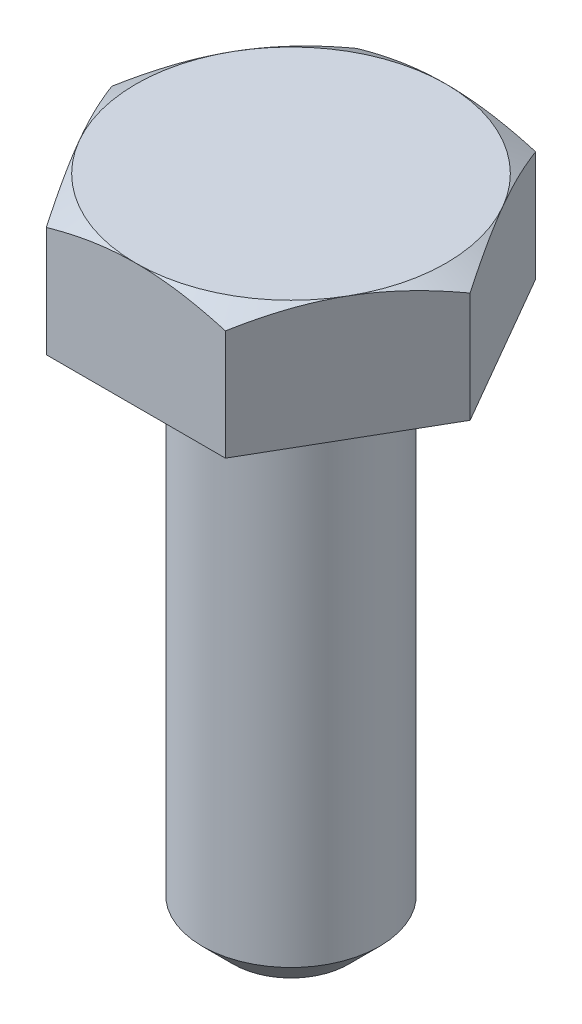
ISO-10303-21;
HEADER;
FILE_DESCRIPTION(('STEP AP214'),'2;1');
FILE_NAME('part.step','',(''),(''),'','','');
FILE_SCHEMA(('AUTOMOTIVE_DESIGN { 1 0 10303 214 1 1 1 1 }'));
ENDSEC;
DATA;
#1=APPLICATION_CONTEXT('core data for automotive mechanical design processes');
#2=APPLICATION_PROTOCOL_DEFINITION('international standard','automotive_design',2000,#1);
#3=PRODUCT_CONTEXT('',#1,'mechanical');
#4=PRODUCT('Part','Part','',(#3));
#5=PRODUCT_RELATED_PRODUCT_CATEGORY('part','',(#4));
#6=PRODUCT_DEFINITION_FORMATION('','',#4);
#7=PRODUCT_DEFINITION_CONTEXT('part definition',#1,'design');
#8=PRODUCT_DEFINITION('design','',#6,#7);
#9=PRODUCT_DEFINITION_SHAPE('','',#8);
#10=(LENGTH_UNIT() NAMED_UNIT(*) SI_UNIT(.MILLI.,.METRE.));
#11=(NAMED_UNIT(*) PLANE_ANGLE_UNIT() SI_UNIT($,.RADIAN.));
#12=(NAMED_UNIT(*) SI_UNIT($,.STERADIAN.) SOLID_ANGLE_UNIT());
#13=UNCERTAINTY_MEASURE_WITH_UNIT(LENGTH_MEASURE(1.E-05),#10,'distance_accuracy_value','');
#14=(GEOMETRIC_REPRESENTATION_CONTEXT(3) GLOBAL_UNCERTAINTY_ASSIGNED_CONTEXT((#13)) GLOBAL_UNIT_ASSIGNED_CONTEXT((#10,
#11,#12)) REPRESENTATION_CONTEXT('',''));
#15=CARTESIAN_POINT('',(0.,0.,0.));
#16=DIRECTION('',(0.,0.,1.));
#17=DIRECTION('',(1.,0.,0.));
#18=AXIS2_PLACEMENT_3D('',#15,#16,#17);
#19=CARTESIAN_POINT('',(0.,2.8,0.));
#20=DIRECTION('',(0.,-1.,0.));
#21=DIRECTION('',(1.,0.,0.));
#22=AXIS2_PLACEMENT_3D('',#19,#20,#21);
#23=PLANE('',#22);
#24=CARTESIAN_POINT('',(0.,2.79999999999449,0.));
#25=DIRECTION('',(0.,-1.,0.));
#26=DIRECTION('',(1.,0.,0.));
#27=AXIS2_PLACEMENT_3D('',#24,#25,#26);
#28=CIRCLE('',#27,3.50000000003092);
#29=CARTESIAN_POINT('',(3.03108891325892,2.80000000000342,1.75000000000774));
#30=VERTEX_POINT('',#29);
#31=CARTESIAN_POINT('',(0.,2.80000000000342,3.50000000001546));
#32=VERTEX_POINT('',#31);
#33=EDGE_CURVE('E89',#30,#32,#28,.T.);
#34=ORIENTED_EDGE('',*,*,#33,.F.);
#35=CARTESIAN_POINT('',(0.,2.79999999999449,0.));
#36=DIRECTION('',(0.,-1.,0.));
#37=DIRECTION('',(1.,0.,0.));
#38=AXIS2_PLACEMENT_3D('',#35,#36,#37);
#39=CIRCLE('',#38,3.50000000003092);
#40=CARTESIAN_POINT('',(3.03108891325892,2.80000000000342,-1.75000000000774));
#41=VERTEX_POINT('',#40);
#42=EDGE_CURVE('E87',#41,#30,#39,.T.);
#43=ORIENTED_EDGE('',*,*,#42,.F.);
#44=CARTESIAN_POINT('',(0.,2.79999999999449,0.));
#45=DIRECTION('',(0.,-1.,0.));
#46=DIRECTION('',(1.,0.,0.));
#47=AXIS2_PLACEMENT_3D('',#44,#45,#46);
#48=CIRCLE('',#47,3.50000000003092);
#49=CARTESIAN_POINT('',(0.,2.80000000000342,-3.50000000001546));
#50=VERTEX_POINT('',#49);
#51=EDGE_CURVE('E20',#50,#41,#48,.T.);
#52=ORIENTED_EDGE('',*,*,#51,.F.);
#53=CARTESIAN_POINT('',(0.,2.79999999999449,0.));
#54=DIRECTION('',(0.,-1.,0.));
#55=DIRECTION('',(1.,0.,0.));
#56=AXIS2_PLACEMENT_3D('',#53,#54,#55);
#57=CIRCLE('',#56,3.50000000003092);
#58=CARTESIAN_POINT('',(-3.03108891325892,2.80000000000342,-1.75000000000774));
#59=VERTEX_POINT('',#58);
#60=EDGE_CURVE('E104',#59,#50,#57,.T.);
#61=ORIENTED_EDGE('',*,*,#60,.F.);
#62=CARTESIAN_POINT('',(0.,2.79999999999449,0.));
#63=DIRECTION('',(0.,-1.,0.));
#64=DIRECTION('',(1.,0.,0.));
#65=AXIS2_PLACEMENT_3D('',#62,#63,#64);
#66=CIRCLE('',#65,3.50000000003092);
#67=CARTESIAN_POINT('',(-3.03108891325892,2.80000000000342,1.75000000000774));
#68=VERTEX_POINT('',#67);
#69=EDGE_CURVE('E323',#68,#59,#66,.T.);
#70=ORIENTED_EDGE('',*,*,#69,.F.);
#71=CARTESIAN_POINT('',(0.,2.79999999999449,0.));
#72=DIRECTION('',(0.,-1.,0.));
#73=DIRECTION('',(1.,0.,0.));
#74=AXIS2_PLACEMENT_3D('',#71,#72,#73);
#75=CIRCLE('',#74,3.50000000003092);
#76=EDGE_CURVE('E93',#32,#68,#75,.T.);
#77=ORIENTED_EDGE('',*,*,#76,.F.);
#78=EDGE_LOOP('',(#34,#43,#52,#61,#70,#77));
#79=FACE_BOUND('',#78,.T.);
#80=ADVANCED_FACE('F16',(#79),#23,.F.);
#81=CARTESIAN_POINT('',(0.,2.48551696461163,0.));
#82=DIRECTION('',(0.,-1.,0.));
#83=DIRECTION('',(1.,0.,0.));
#84=AXIS2_PLACEMENT_3D('',#81,#82,#83);
#85=CONICAL_SURFACE('',#84,4.04470059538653,1.04719755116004);
#86=ORIENTED_EDGE('',*,*,#51,.T.);
#87=CARTESIAN_POINT('',(2.02072594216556,2.4873926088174,-3.49999999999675));
#88=CARTESIAN_POINT('',(2.10296905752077,2.53488760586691,-3.35755074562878));
#89=CARTESIAN_POINT('',(2.18587080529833,2.5784013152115,-3.21396070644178));
#90=CARTESIAN_POINT('',(2.3524050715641,2.65513695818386,-2.92551489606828));
#91=CARTESIAN_POINT('',(2.43603178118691,2.68840978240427,-2.78066918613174));
#92=CARTESIAN_POINT('',(2.56226107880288,2.72926316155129,-2.56203362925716));
#93=CARTESIAN_POINT('',(2.60449696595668,2.741376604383,-2.48887892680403));
#94=CARTESIAN_POINT('',(2.68917094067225,2.762345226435,-2.34221930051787));
#95=CARTESIAN_POINT('',(2.7316090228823,2.771200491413,-2.26871438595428));
#96=CARTESIAN_POINT('',(2.81684436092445,2.78549717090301,-2.12108244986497));
#97=CARTESIAN_POINT('',(2.85964235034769,2.79092122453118,-2.04695415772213));
#98=CARTESIAN_POINT('',(2.94532249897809,2.79818014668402,-1.89855178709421));
#99=CARTESIAN_POINT('',(2.98820467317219,2.80001430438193,-1.82427768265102));
#100=CARTESIAN_POINT('',(3.03108891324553,2.80000000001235,-1.75000000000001));
#101=B_SPLINE_CURVE_WITH_KNOTS('',3,(#87,#88,#89,#90,#91,#92,#93,#94,#95,#96,#97,#98,#99,#100),
.UNSPECIFIED.,.F.,.F.,(4,2,2,2,2,2,4),(0.,0.513825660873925,1.02505510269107,1.28100524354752,
1.53694864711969,1.7941769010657,2.05145608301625),.UNSPECIFIED.);
#102=CARTESIAN_POINT('',(2.02072594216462,2.48739260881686,-3.49999999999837));
#103=VERTEX_POINT('',#102);
#104=EDGE_CURVE('E99',#103,#41,#101,.T.);
#105=ORIENTED_EDGE('',*,*,#104,.F.);
#106=CARTESIAN_POINT('',(0.,2.80000000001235,-3.49999999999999));
#107=CARTESIAN_POINT('',(0.0857684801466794,2.80001430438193,-3.49999999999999));
#108=CARTESIAN_POINT('',(0.171532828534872,2.79818014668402,-3.49999999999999));
#109=CARTESIAN_POINT('',(0.342893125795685,2.79092122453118,-3.49999999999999));
#110=CARTESIAN_POINT('',(0.428489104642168,2.78549717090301,-3.49999999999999));
#111=CARTESIAN_POINT('',(0.598959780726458,2.77120049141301,-3.49999999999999));
#112=CARTESIAN_POINT('',(0.683835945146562,2.76234522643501,-3.49999999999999));
#113=CARTESIAN_POINT('',(0.853183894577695,2.74137660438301,-3.49999999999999));
#114=CARTESIAN_POINT('',(0.937655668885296,2.7292631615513,-3.49999999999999));
#115=CARTESIAN_POINT('',(1.19011426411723,2.68840978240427,-3.49999999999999));
#116=CARTESIAN_POINT('',(1.35736768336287,2.65513695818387,-3.49999999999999));
#117=CARTESIAN_POINT('',(1.69043621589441,2.5784013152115,-3.49999999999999));
#118=CARTESIAN_POINT('',(1.85623971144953,2.53488760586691,-3.49999999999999));
#119=CARTESIAN_POINT('',(2.02072594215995,2.4873926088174,-3.49999999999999));
#120=B_SPLINE_CURVE_WITH_KNOTS('',3,(#106,#107,#108,#109,#110,#111,#112,#113,#114,#115,#116,
#117,#118,#119),.UNSPECIFIED.,.F.,.F.,(4,2,2,2,2,2,4),(0.,0.257279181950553,0.514507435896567,
0.770450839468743,1.02640098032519,1.53763042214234,2.05145608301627),.UNSPECIFIED.);
#121=EDGE_CURVE('E102',#50,#103,#120,.T.);
#122=ORIENTED_EDGE('',*,*,#121,.F.);
#123=EDGE_LOOP('',(#86,#105,#122));
#124=FACE_BOUND('',#123,.T.);
#125=ADVANCED_FACE('F97',(#124),#85,.T.);
#126=CARTESIAN_POINT('',(0.,2.48551696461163,0.));
#127=DIRECTION('',(0.,-1.,0.));
#128=DIRECTION('',(1.,0.,0.));
#129=AXIS2_PLACEMENT_3D('',#126,#127,#128);
#130=CONICAL_SURFACE('',#129,4.04470059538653,1.04719755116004);
#131=ORIENTED_EDGE('',*,*,#60,.T.);
#132=CARTESIAN_POINT('',(-2.02072594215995,2.4873926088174,-3.49999999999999));
#133=CARTESIAN_POINT('',(-1.85623971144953,2.53488760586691,-3.49999999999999));
#134=CARTESIAN_POINT('',(-1.69043621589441,2.5784013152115,-3.49999999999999));
#135=CARTESIAN_POINT('',(-1.35736768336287,2.65513695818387,-3.49999999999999));
#136=CARTESIAN_POINT('',(-1.19011426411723,2.68840978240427,-3.49999999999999));
#137=CARTESIAN_POINT('',(-0.937655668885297,2.7292631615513,-3.49999999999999));
#138=CARTESIAN_POINT('',(-0.853183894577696,2.74137660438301,-3.49999999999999));
#139=CARTESIAN_POINT('',(-0.683835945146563,2.76234522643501,-3.49999999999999));
#140=CARTESIAN_POINT('',(-0.598959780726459,2.77120049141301,-3.49999999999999));
#141=CARTESIAN_POINT('',(-0.428489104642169,2.78549717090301,-3.49999999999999));
#142=CARTESIAN_POINT('',(-0.342893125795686,2.79092122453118,-3.49999999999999));
#143=CARTESIAN_POINT('',(-0.171532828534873,2.79818014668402,-3.49999999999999));
#144=CARTESIAN_POINT('',(-0.0857684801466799,2.80001430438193,-3.49999999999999));
#145=CARTESIAN_POINT('',(0.,2.80000000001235,-3.49999999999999));
#146=B_SPLINE_CURVE_WITH_KNOTS('',3,(#132,#133,#134,#135,#136,#137,#138,#139,#140,#141,#142,
#143,#144,#145),.UNSPECIFIED.,.F.,.F.,(4,2,2,2,2,2,4),(0.,0.513825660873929,1.02505510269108,
1.28100524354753,1.53694864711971,1.79417690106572,2.05145608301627),.UNSPECIFIED.);
#147=CARTESIAN_POINT('',(-2.02072594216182,2.48739260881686,-3.49999999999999));
#148=VERTEX_POINT('',#147);
#149=EDGE_CURVE('E113',#148,#50,#146,.T.);
#150=ORIENTED_EDGE('',*,*,#149,.F.);
#151=CARTESIAN_POINT('',(-3.03108891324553,2.80000000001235,-1.75000000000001));
#152=CARTESIAN_POINT('',(-2.98820467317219,2.80001430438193,-1.82427768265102));
#153=CARTESIAN_POINT('',(-2.94532249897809,2.79818014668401,-1.89855178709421));
#154=CARTESIAN_POINT('',(-2.85964235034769,2.79092122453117,-2.04695415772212));
#155=CARTESIAN_POINT('',(-2.81684436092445,2.78549717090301,-2.12108244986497));
#156=CARTESIAN_POINT('',(-2.7316090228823,2.771200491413,-2.26871438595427));
#157=CARTESIAN_POINT('',(-2.68917094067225,2.762345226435,-2.34221930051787));
#158=CARTESIAN_POINT('',(-2.60449696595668,2.741376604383,-2.48887892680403));
#159=CARTESIAN_POINT('',(-2.56226107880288,2.72926316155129,-2.56203362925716));
#160=CARTESIAN_POINT('',(-2.43603178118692,2.68840978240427,-2.78066918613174));
#161=CARTESIAN_POINT('',(-2.3524050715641,2.65513695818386,-2.92551489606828));
#162=CARTESIAN_POINT('',(-2.18587080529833,2.5784013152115,-3.21396070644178));
#163=CARTESIAN_POINT('',(-2.10296905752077,2.53488760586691,-3.35755074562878));
#164=CARTESIAN_POINT('',(-2.02072594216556,2.4873926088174,-3.49999999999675));
#165=B_SPLINE_CURVE_WITH_KNOTS('',3,(#151,#152,#153,#154,#155,#156,#157,#158,#159,#160,#161,
#162,#163,#164),.UNSPECIFIED.,.F.,.F.,(4,2,2,2,2,2,4),(0.,0.257279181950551,0.514507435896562,
0.770450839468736,1.02640098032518,1.53763042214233,2.05145608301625),.UNSPECIFIED.);
#166=EDGE_CURVE('E169',#59,#148,#165,.T.);
#167=ORIENTED_EDGE('',*,*,#166,.F.);
#168=EDGE_LOOP('',(#131,#150,#167));
#169=FACE_BOUND('',#168,.T.);
#170=ADVANCED_FACE('F137',(#169),#130,.T.);
#171=CARTESIAN_POINT('',(0.,2.48551696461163,0.));
#172=DIRECTION('',(0.,-1.,0.));
#173=DIRECTION('',(1.,0.,0.));
#174=AXIS2_PLACEMENT_3D('',#171,#172,#173);
#175=CONICAL_SURFACE('',#174,4.04470059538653,1.04719755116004);
#176=ORIENTED_EDGE('',*,*,#69,.T.);
#177=CARTESIAN_POINT('',(-4.04145188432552,2.48739260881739,-3.24094856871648E-12));
#178=CARTESIAN_POINT('',(-3.95920876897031,2.5348876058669,-0.142449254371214));
#179=CARTESIAN_POINT('',(-3.87630702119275,2.57840131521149,-0.286039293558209));
#180=CARTESIAN_POINT('',(-3.70977275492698,2.65513695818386,-0.574485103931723));
#181=CARTESIAN_POINT('',(-3.62614604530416,2.68840978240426,-0.719330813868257));
#182=CARTESIAN_POINT('',(-3.49991674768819,2.72926316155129,-0.937966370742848));
#183=CARTESIAN_POINT('',(-3.45768086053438,2.741376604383,-1.01112107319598));
#184=CARTESIAN_POINT('',(-3.37300688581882,2.762345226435,-1.15778069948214));
#185=CARTESIAN_POINT('',(-3.33056880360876,2.771200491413,-1.23128561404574));
#186=CARTESIAN_POINT('',(-3.24533346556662,2.78549717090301,-1.37891755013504));
#187=CARTESIAN_POINT('',(-3.20253547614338,2.79092122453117,-1.45304584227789));
#188=CARTESIAN_POINT('',(-3.11685532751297,2.79818014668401,-1.60144821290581));
#189=CARTESIAN_POINT('',(-3.07397315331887,2.80001430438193,-1.675722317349));
#190=CARTESIAN_POINT('',(-3.03108891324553,2.80000000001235,-1.75000000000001));
#191=B_SPLINE_CURVE_WITH_KNOTS('',3,(#177,#178,#179,#180,#181,#182,#183,#184,#185,#186,#187,
#188,#189,#190),.UNSPECIFIED.,.F.,.F.,(4,2,2,2,2,2,4),(0.,0.513825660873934,1.02505510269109,
1.28100524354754,1.53694864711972,1.79417690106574,2.05145608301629),.UNSPECIFIED.);
#192=CARTESIAN_POINT('',(-4.04145188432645,2.48739260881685,-1.62018098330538E-12));
#193=VERTEX_POINT('',#192);
#194=EDGE_CURVE('E146',#193,#59,#191,.T.);
#195=ORIENTED_EDGE('',*,*,#194,.F.);
#196=CARTESIAN_POINT('',(-3.03108891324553,2.80000000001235,1.75000000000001));
#197=CARTESIAN_POINT('',(-3.07397315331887,2.80001430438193,1.675722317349));
#198=CARTESIAN_POINT('',(-3.11685532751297,2.79818014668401,1.60144821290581));
#199=CARTESIAN_POINT('',(-3.20253547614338,2.79092122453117,1.45304584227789));
#200=CARTESIAN_POINT('',(-3.24533346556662,2.78549717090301,1.37891755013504));
#201=CARTESIAN_POINT('',(-3.33056880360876,2.771200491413,1.23128561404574));
#202=CARTESIAN_POINT('',(-3.37300688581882,2.762345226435,1.15778069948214));
#203=CARTESIAN_POINT('',(-3.45768086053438,2.741376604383,1.01112107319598));
#204=CARTESIAN_POINT('',(-3.49991674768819,2.72926316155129,0.937966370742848));
#205=CARTESIAN_POINT('',(-3.62614604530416,2.68840978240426,0.719330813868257));
#206=CARTESIAN_POINT('',(-3.70977275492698,2.65513695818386,0.574485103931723));
#207=CARTESIAN_POINT('',(-3.87630702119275,2.57840131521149,0.286039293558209));
#208=CARTESIAN_POINT('',(-3.95920876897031,2.5348876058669,0.142449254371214));
#209=CARTESIAN_POINT('',(-4.04145188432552,2.48739260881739,3.2412585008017E-12));
#210=B_SPLINE_CURVE_WITH_KNOTS('',3,(#196,#197,#198,#199,#200,#201,#202,#203,#204,#205,#206,
#207,#208,#209),.UNSPECIFIED.,.F.,.F.,(4,2,2,2,2,2,4),(0.,0.257279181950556,0.514507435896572,
0.77045083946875,1.0264009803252,1.53763042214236,2.05145608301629),.UNSPECIFIED.);
#211=EDGE_CURVE('E183',#68,#193,#210,.T.);
#212=ORIENTED_EDGE('',*,*,#211,.F.);
#213=EDGE_LOOP('',(#176,#195,#212));
#214=FACE_BOUND('',#213,.T.);
#215=ADVANCED_FACE('F191',(#214),#175,.T.);
#216=CARTESIAN_POINT('',(0.,2.48551696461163,0.));
#217=DIRECTION('',(0.,-1.,0.));
#218=DIRECTION('',(1.,0.,0.));
#219=AXIS2_PLACEMENT_3D('',#216,#217,#218);
#220=CONICAL_SURFACE('',#219,4.04470059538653,1.04719755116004);
#221=ORIENTED_EDGE('',*,*,#76,.T.);
#222=CARTESIAN_POINT('',(-2.02072594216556,2.4873926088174,3.49999999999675));
#223=CARTESIAN_POINT('',(-2.10296905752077,2.53488760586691,3.35755074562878));
#224=CARTESIAN_POINT('',(-2.18587080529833,2.5784013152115,3.21396070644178));
#225=CARTESIAN_POINT('',(-2.3524050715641,2.65513695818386,2.92551489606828));
#226=CARTESIAN_POINT('',(-2.43603178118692,2.68840978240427,2.78066918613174));
#227=CARTESIAN_POINT('',(-2.56226107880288,2.72926316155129,2.56203362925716));
#228=CARTESIAN_POINT('',(-2.60449696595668,2.741376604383,2.48887892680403));
#229=CARTESIAN_POINT('',(-2.68917094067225,2.762345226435,2.34221930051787));
#230=CARTESIAN_POINT('',(-2.7316090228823,2.771200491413,2.26871438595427));
#231=CARTESIAN_POINT('',(-2.81684436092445,2.78549717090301,2.12108244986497));
#232=CARTESIAN_POINT('',(-2.85964235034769,2.79092122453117,2.04695415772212));
#233=CARTESIAN_POINT('',(-2.94532249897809,2.79818014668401,1.89855178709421));
#234=CARTESIAN_POINT('',(-2.98820467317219,2.80001430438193,1.82427768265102));
#235=CARTESIAN_POINT('',(-3.03108891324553,2.80000000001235,1.75000000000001));
#236=B_SPLINE_CURVE_WITH_KNOTS('',3,(#222,#223,#224,#225,#226,#227,#228,#229,#230,#231,#232,
#233,#234,#235),.UNSPECIFIED.,.F.,.F.,(4,2,2,2,2,2,4),(0.,0.513825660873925,1.02505510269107,
1.28100524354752,1.53694864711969,1.7941769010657,2.05145608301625),.UNSPECIFIED.);
#237=CARTESIAN_POINT('',(-2.02072594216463,2.48739260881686,3.49999999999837));
#238=VERTEX_POINT('',#237);
#239=EDGE_CURVE('E176',#238,#68,#236,.T.);
#240=ORIENTED_EDGE('',*,*,#239,.F.);
#241=CARTESIAN_POINT('',(0.,2.80000000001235,3.49999999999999));
#242=CARTESIAN_POINT('',(-0.0857684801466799,2.80001430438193,3.49999999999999));
#243=CARTESIAN_POINT('',(-0.171532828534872,2.79818014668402,3.49999999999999));
#244=CARTESIAN_POINT('',(-0.342893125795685,2.79092122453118,3.49999999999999));
#245=CARTESIAN_POINT('',(-0.428489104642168,2.78549717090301,3.49999999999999));
#246=CARTESIAN_POINT('',(-0.598959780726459,2.77120049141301,3.49999999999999));
#247=CARTESIAN_POINT('',(-0.683835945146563,2.76234522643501,3.49999999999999));
#248=CARTESIAN_POINT('',(-0.853183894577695,2.74137660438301,3.49999999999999));
#249=CARTESIAN_POINT('',(-0.937655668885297,2.7292631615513,3.49999999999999));
#250=CARTESIAN_POINT('',(-1.19011426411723,2.68840978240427,3.49999999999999));
#251=CARTESIAN_POINT('',(-1.35736768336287,2.65513695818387,3.49999999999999));
#252=CARTESIAN_POINT('',(-1.69043621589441,2.5784013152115,3.49999999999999));
#253=CARTESIAN_POINT('',(-1.85623971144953,2.53488760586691,3.49999999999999));
#254=CARTESIAN_POINT('',(-2.02072594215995,2.4873926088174,3.49999999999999));
#255=B_SPLINE_CURVE_WITH_KNOTS('',3,(#241,#242,#243,#244,#245,#246,#247,#248,#249,#250,#251,
#252,#253,#254),.UNSPECIFIED.,.F.,.F.,(4,2,2,2,2,2,4),(0.,0.257279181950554,0.514507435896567,
0.770450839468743,1.02640098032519,1.53763042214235,2.05145608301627),.UNSPECIFIED.);
#256=EDGE_CURVE('E198',#32,#238,#255,.T.);
#257=ORIENTED_EDGE('',*,*,#256,.F.);
#258=EDGE_LOOP('',(#221,#240,#257));
#259=FACE_BOUND('',#258,.T.);
#260=ADVANCED_FACE('F188',(#259),#220,.T.);
#261=CARTESIAN_POINT('',(0.,2.48551696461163,0.));
#262=DIRECTION('',(0.,-1.,0.));
#263=DIRECTION('',(1.,0.,0.));
#264=AXIS2_PLACEMENT_3D('',#261,#262,#263);
#265=CONICAL_SURFACE('',#264,4.04470059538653,1.04719755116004);
#266=ORIENTED_EDGE('',*,*,#42,.T.);
#267=CARTESIAN_POINT('',(4.04145188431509,2.48739260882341,2.13024001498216E-11));
#268=CARTESIAN_POINT('',(3.9592087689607,2.53488760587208,0.142449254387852));
#269=CARTESIAN_POINT('',(3.87630702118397,2.57840131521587,0.286039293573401));
#270=CARTESIAN_POINT('',(3.70977275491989,2.65513695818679,0.574485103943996));
#271=CARTESIAN_POINT('',(3.62614604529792,2.68840978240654,0.719330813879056));
#272=CARTESIAN_POINT('',(3.49991674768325,2.72926316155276,0.937966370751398));
#273=CARTESIAN_POINT('',(3.45768086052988,2.74137660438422,1.01112107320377));
#274=CARTESIAN_POINT('',(3.3730068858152,2.76234522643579,1.15778069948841));
#275=CARTESIAN_POINT('',(3.33056880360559,2.77120049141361,1.23128561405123));
#276=CARTESIAN_POINT('',(3.24533346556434,2.78549717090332,1.37891755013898));
#277=CARTESIAN_POINT('',(3.20253547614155,2.79092122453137,1.45304584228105));
#278=CARTESIAN_POINT('',(3.11685532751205,2.79818014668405,1.60144821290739));
#279=CARTESIAN_POINT('',(3.07397315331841,2.80001430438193,1.6757223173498));
#280=CARTESIAN_POINT('',(3.03108891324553,2.80000000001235,1.75000000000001));
#281=B_SPLINE_CURVE_WITH_KNOTS('',3,(#267,#268,#269,#270,#271,#272,#273,#274,#275,#276,#277,
#278,#279,#280),.UNSPECIFIED.,.F.,.F.,(4,2,2,2,2,2,4),(0.,0.51382566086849,1.02505510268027,
1.28100524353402,1.53694864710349,1.79417690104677,2.05145608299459),.UNSPECIFIED.);
#282=CARTESIAN_POINT('',(4.04145188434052,2.48739260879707,-1.0651035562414E-11));
#283=VERTEX_POINT('',#282);
#284=EDGE_CURVE('E109',#283,#30,#281,.T.);
#285=ORIENTED_EDGE('',*,*,#284,.F.);
#286=CARTESIAN_POINT('',(3.03108891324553,2.80000000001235,-1.75000000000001));
#287=CARTESIAN_POINT('',(3.07397315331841,2.80001430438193,-1.6757223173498));
#288=CARTESIAN_POINT('',(3.11685532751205,2.79818014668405,-1.60144821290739));
#289=CARTESIAN_POINT('',(3.20253547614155,2.79092122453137,-1.45304584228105));
#290=CARTESIAN_POINT('',(3.24533346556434,2.78549717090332,-1.37891755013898));
#291=CARTESIAN_POINT('',(3.33056880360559,2.77120049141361,-1.23128561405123));
#292=CARTESIAN_POINT('',(3.3730068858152,2.76234522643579,-1.15778069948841));
#293=CARTESIAN_POINT('',(3.45768086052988,2.74137660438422,-1.01112107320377));
#294=CARTESIAN_POINT('',(3.49991674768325,2.72926316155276,-0.937966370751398));
#295=CARTESIAN_POINT('',(3.62614604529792,2.68840978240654,-0.719330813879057));
#296=CARTESIAN_POINT('',(3.70977275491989,2.65513695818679,-0.574485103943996));
#297=CARTESIAN_POINT('',(3.87630702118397,2.57840131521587,-0.286039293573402));
#298=CARTESIAN_POINT('',(3.9592087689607,2.53488760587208,-0.142449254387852));
#299=CARTESIAN_POINT('',(4.04145188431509,2.48739260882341,-2.13026023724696E-11));
#300=B_SPLINE_CURVE_WITH_KNOTS('',3,(#286,#287,#288,#289,#290,#291,#292,#293,#294,#295,#296,
#297,#298,#299),.UNSPECIFIED.,.F.,.F.,(4,2,2,2,2,2,4),(0.,0.257279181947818,0.514507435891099,
0.770450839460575,1.02640098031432,1.5376304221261,2.05145608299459),.UNSPECIFIED.);
#301=EDGE_CURVE('E106',#41,#283,#300,.T.);
#302=ORIENTED_EDGE('',*,*,#301,.F.);
#303=EDGE_LOOP('',(#266,#285,#302));
#304=FACE_BOUND('',#303,.T.);
#305=ADVANCED_FACE('F107',(#304),#265,.T.);
#306=CARTESIAN_POINT('',(0.,2.48551696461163,0.));
#307=DIRECTION('',(0.,-1.,0.));
#308=DIRECTION('',(1.,0.,0.));
#309=AXIS2_PLACEMENT_3D('',#306,#307,#308);
#310=CONICAL_SURFACE('',#309,4.04470059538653,1.04719755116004);
#311=ORIENTED_EDGE('',*,*,#33,.T.);
#312=CARTESIAN_POINT('',(2.02072594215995,2.4873926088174,3.49999999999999));
#313=CARTESIAN_POINT('',(1.85623971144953,2.53488760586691,3.49999999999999));
#314=CARTESIAN_POINT('',(1.69043621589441,2.5784013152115,3.49999999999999));
#315=CARTESIAN_POINT('',(1.35736768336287,2.65513695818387,3.49999999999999));
#316=CARTESIAN_POINT('',(1.19011426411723,2.68840978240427,3.49999999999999));
#317=CARTESIAN_POINT('',(0.937655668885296,2.7292631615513,3.49999999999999));
#318=CARTESIAN_POINT('',(0.853183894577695,2.74137660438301,3.49999999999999));
#319=CARTESIAN_POINT('',(0.683835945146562,2.76234522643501,3.49999999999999));
#320=CARTESIAN_POINT('',(0.598959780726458,2.77120049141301,3.49999999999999));
#321=CARTESIAN_POINT('',(0.428489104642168,2.78549717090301,3.49999999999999));
#322=CARTESIAN_POINT('',(0.342893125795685,2.79092122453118,3.49999999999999));
#323=CARTESIAN_POINT('',(0.171532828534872,2.79818014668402,3.49999999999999));
#324=CARTESIAN_POINT('',(0.0857684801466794,2.80001430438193,3.49999999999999));
#325=CARTESIAN_POINT('',(0.,2.80000000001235,3.49999999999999));
#326=B_SPLINE_CURVE_WITH_KNOTS('',3,(#312,#313,#314,#315,#316,#317,#318,#319,#320,#321,#322,
#323,#324,#325),.UNSPECIFIED.,.F.,.F.,(4,2,2,2,2,2,4),(0.,0.513825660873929,1.02505510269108,
1.28100524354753,1.53694864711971,1.79417690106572,2.05145608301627),.UNSPECIFIED.);
#327=CARTESIAN_POINT('',(2.02072594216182,2.48739260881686,3.49999999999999));
#328=VERTEX_POINT('',#327);
#329=EDGE_CURVE('E205',#328,#32,#326,.T.);
#330=ORIENTED_EDGE('',*,*,#329,.F.);
#331=CARTESIAN_POINT('',(3.03108891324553,2.80000000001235,1.75000000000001));
#332=CARTESIAN_POINT('',(2.98820467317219,2.80001430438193,1.82427768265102));
#333=CARTESIAN_POINT('',(2.94532249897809,2.79818014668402,1.89855178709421));
#334=CARTESIAN_POINT('',(2.85964235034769,2.79092122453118,2.04695415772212));
#335=CARTESIAN_POINT('',(2.81684436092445,2.78549717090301,2.12108244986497));
#336=CARTESIAN_POINT('',(2.7316090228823,2.771200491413,2.26871438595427));
#337=CARTESIAN_POINT('',(2.68917094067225,2.762345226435,2.34221930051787));
#338=CARTESIAN_POINT('',(2.60449696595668,2.741376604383,2.48887892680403));
#339=CARTESIAN_POINT('',(2.56226107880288,2.72926316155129,2.56203362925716));
#340=CARTESIAN_POINT('',(2.43603178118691,2.68840978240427,2.78066918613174));
#341=CARTESIAN_POINT('',(2.3524050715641,2.65513695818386,2.92551489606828));
#342=CARTESIAN_POINT('',(2.18587080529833,2.5784013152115,3.21396070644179));
#343=CARTESIAN_POINT('',(2.10296905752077,2.53488760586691,3.35755074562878));
#344=CARTESIAN_POINT('',(2.02072594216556,2.4873926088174,3.49999999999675));
#345=B_SPLINE_CURVE_WITH_KNOTS('',3,(#331,#332,#333,#334,#335,#336,#337,#338,#339,#340,#341,
#342,#343,#344),.UNSPECIFIED.,.F.,.F.,(4,2,2,2,2,2,4),(0.,0.257279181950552,0.514507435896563,
0.770450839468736,1.02640098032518,1.53763042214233,2.05145608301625),.UNSPECIFIED.);
#346=EDGE_CURVE('E225',#30,#328,#345,.T.);
#347=ORIENTED_EDGE('',*,*,#346,.F.);
#348=EDGE_LOOP('',(#311,#330,#347));
#349=FACE_BOUND('',#348,.T.);
#350=ADVANCED_FACE('F233',(#349),#310,.T.);
#351=CARTESIAN_POINT('',(0.,-12.,0.));
#352=DIRECTION('',(0.,1.,0.));
#353=DIRECTION('',(0.,0.,1.));
#354=AXIS2_PLACEMENT_3D('',#351,#352,#353);
#355=PLANE('',#354);
#356=CARTESIAN_POINT('',(0.,-11.9999999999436,0.));
#357=DIRECTION('',(0.,1.,0.));
#358=DIRECTION('',(0.,0.,1.));
#359=AXIS2_PLACEMENT_3D('',#356,#357,#358);
#360=CIRCLE('',#359,1.30000000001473);
#361=CARTESIAN_POINT('',(0.,-11.9999999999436,1.30000000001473));
#362=VERTEX_POINT('',#361);
#363=EDGE_CURVE('E232',#362,#362,#360,.T.);
#364=ORIENTED_EDGE('',*,*,#363,.F.);
#365=EDGE_LOOP('',(#364));
#366=FACE_BOUND('',#365,.T.);
#367=ADVANCED_FACE('F236',(#366),#355,.F.);
#368=CARTESIAN_POINT('',(2.02072594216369,16.94,-3.49999999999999));
#369=DIRECTION('',(0.866025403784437,0.,-0.500000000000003));
#370=DIRECTION('',(-0.500000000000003,0.,-0.866025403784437));
#371=AXIS2_PLACEMENT_3D('',#368,#369,#370);
#372=PLANE('',#371);
#373=DIRECTION('',(-0.500000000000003,0.,-0.866025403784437));
#374=VECTOR('',#373,1.);
#375=CARTESIAN_POINT('',(4.04145188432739,0.,0.));
#376=LINE('',#375,#374);
#377=CARTESIAN_POINT('',(4.04145188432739,0.,0.));
#378=VERTEX_POINT('',#377);
#379=CARTESIAN_POINT('',(2.02072594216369,0.,-3.49999999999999));
#380=VERTEX_POINT('',#379);
#381=EDGE_CURVE('E268',#378,#380,#376,.T.);
#382=ORIENTED_EDGE('',*,*,#381,.T.);
#383=DIRECTION('',(0.,1.,0.));
#384=VECTOR('',#383,1.);
#385=CARTESIAN_POINT('',(2.02072594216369,16.94,-3.49999999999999));
#386=LINE('',#385,#384);
#387=EDGE_CURVE('E117',#103,#380,#386,.F.);
#388=ORIENTED_EDGE('',*,*,#387,.F.);
#389=ORIENTED_EDGE('',*,*,#104,.T.);
#390=ORIENTED_EDGE('',*,*,#301,.T.);
#391=DIRECTION('',(0.,1.,0.));
#392=VECTOR('',#391,1.);
#393=CARTESIAN_POINT('',(4.04145188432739,16.94,0.));
#394=LINE('',#393,#392);
#395=EDGE_CURVE('E312',#378,#283,#394,.T.);
#396=ORIENTED_EDGE('',*,*,#395,.F.);
#397=EDGE_LOOP('',(#382,#388,#389,#390,#396));
#398=FACE_BOUND('',#397,.T.);
#399=ADVANCED_FACE('F115',(#398),#372,.T.);
#400=CARTESIAN_POINT('',(-2.02072594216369,16.94,-3.49999999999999));
#401=DIRECTION('',(0.,0.,-1.));
#402=DIRECTION('',(-1.,0.,0.));
#403=AXIS2_PLACEMENT_3D('',#400,#401,#402);
#404=PLANE('',#403);
#405=DIRECTION('',(-1.,0.,0.));
#406=VECTOR('',#405,1.);
#407=CARTESIAN_POINT('',(0.,0.,-3.49999999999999));
#408=LINE('',#407,#406);
#409=CARTESIAN_POINT('',(-2.02072594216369,0.,-3.49999999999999));
#410=VERTEX_POINT('',#409);
#411=EDGE_CURVE('E270',#380,#410,#408,.T.);
#412=ORIENTED_EDGE('',*,*,#411,.T.);
#413=DIRECTION('',(0.,1.,0.));
#414=VECTOR('',#413,1.);
#415=CARTESIAN_POINT('',(-2.02072594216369,16.94,-3.49999999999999));
#416=LINE('',#415,#414);
#417=EDGE_CURVE('E175',#148,#410,#416,.F.);
#418=ORIENTED_EDGE('',*,*,#417,.F.);
#419=ORIENTED_EDGE('',*,*,#149,.T.);
#420=ORIENTED_EDGE('',*,*,#121,.T.);
#421=ORIENTED_EDGE('',*,*,#387,.T.);
#422=EDGE_LOOP('',(#412,#418,#419,#420,#421));
#423=FACE_BOUND('',#422,.T.);
#424=ADVANCED_FACE('F155',(#423),#404,.T.);
#425=CARTESIAN_POINT('',(-2.02072594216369,16.94,-3.49999999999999));
#426=DIRECTION('',(-0.866025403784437,0.,-0.500000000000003));
#427=DIRECTION('',(-0.500000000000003,0.,0.866025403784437));
#428=AXIS2_PLACEMENT_3D('',#425,#426,#427);
#429=PLANE('',#428);
#430=DIRECTION('',(-0.500000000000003,0.,0.866025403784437));
#431=VECTOR('',#430,1.);
#432=CARTESIAN_POINT('',(-2.02072594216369,0.,-3.49999999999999));
#433=LINE('',#432,#431);
#434=CARTESIAN_POINT('',(-4.04145188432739,0.,0.));
#435=VERTEX_POINT('',#434);
#436=EDGE_CURVE('E278',#410,#435,#433,.T.);
#437=ORIENTED_EDGE('',*,*,#436,.T.);
#438=DIRECTION('',(0.,1.,0.));
#439=VECTOR('',#438,1.);
#440=CARTESIAN_POINT('',(-4.04145188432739,16.94,0.));
#441=LINE('',#440,#439);
#442=EDGE_CURVE('E302',#193,#435,#441,.F.);
#443=ORIENTED_EDGE('',*,*,#442,.F.);
#444=ORIENTED_EDGE('',*,*,#194,.T.);
#445=ORIENTED_EDGE('',*,*,#166,.T.);
#446=ORIENTED_EDGE('',*,*,#417,.T.);
#447=EDGE_LOOP('',(#437,#443,#444,#445,#446));
#448=FACE_BOUND('',#447,.T.);
#449=ADVANCED_FACE('F158',(#448),#429,.T.);
#450=CARTESIAN_POINT('',(-2.02072594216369,16.94,3.49999999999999));
#451=DIRECTION('',(-0.866025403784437,0.,0.500000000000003));
#452=DIRECTION('',(0.500000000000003,0.,0.866025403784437));
#453=AXIS2_PLACEMENT_3D('',#450,#451,#452);
#454=PLANE('',#453);
#455=DIRECTION('',(0.500000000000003,0.,0.866025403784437));
#456=VECTOR('',#455,1.);
#457=CARTESIAN_POINT('',(-4.04145188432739,0.,0.));
#458=LINE('',#457,#456);
#459=CARTESIAN_POINT('',(-2.02072594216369,0.,3.49999999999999));
#460=VERTEX_POINT('',#459);
#461=EDGE_CURVE('E274',#435,#460,#458,.T.);
#462=ORIENTED_EDGE('',*,*,#461,.T.);
#463=DIRECTION('',(0.,1.,0.));
#464=VECTOR('',#463,1.);
#465=CARTESIAN_POINT('',(-2.02072594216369,16.94,3.49999999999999));
#466=LINE('',#465,#464);
#467=EDGE_CURVE('E204',#238,#460,#466,.F.);
#468=ORIENTED_EDGE('',*,*,#467,.F.);
#469=ORIENTED_EDGE('',*,*,#239,.T.);
#470=ORIENTED_EDGE('',*,*,#211,.T.);
#471=ORIENTED_EDGE('',*,*,#442,.T.);
#472=EDGE_LOOP('',(#462,#468,#469,#470,#471));
#473=FACE_BOUND('',#472,.T.);
#474=ADVANCED_FACE('F164',(#473),#454,.T.);
#475=CARTESIAN_POINT('',(-2.02072594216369,16.94,3.49999999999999));
#476=DIRECTION('',(0.,0.,1.));
#477=DIRECTION('',(1.,0.,0.));
#478=AXIS2_PLACEMENT_3D('',#475,#476,#477);
#479=PLANE('',#478);
#480=DIRECTION('',(-1.,0.,0.));
#481=VECTOR('',#480,1.);
#482=CARTESIAN_POINT('',(0.,0.,3.49999999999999));
#483=LINE('',#482,#481);
#484=CARTESIAN_POINT('',(2.02072594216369,0.,3.49999999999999));
#485=VERTEX_POINT('',#484);
#486=EDGE_CURVE('E35',#460,#485,#483,.F.);
#487=ORIENTED_EDGE('',*,*,#486,.T.);
#488=DIRECTION('',(0.,1.,0.));
#489=VECTOR('',#488,1.);
#490=CARTESIAN_POINT('',(2.02072594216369,16.94,3.49999999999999));
#491=LINE('',#490,#489);
#492=EDGE_CURVE('E231',#328,#485,#491,.F.);
#493=ORIENTED_EDGE('',*,*,#492,.F.);
#494=ORIENTED_EDGE('',*,*,#329,.T.);
#495=ORIENTED_EDGE('',*,*,#256,.T.);
#496=ORIENTED_EDGE('',*,*,#467,.T.);
#497=EDGE_LOOP('',(#487,#493,#494,#495,#496));
#498=FACE_BOUND('',#497,.T.);
#499=ADVANCED_FACE('F214',(#498),#479,.T.);
#500=CARTESIAN_POINT('',(2.02072594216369,16.94,3.49999999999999));
#501=DIRECTION('',(0.866025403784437,0.,0.500000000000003));
#502=DIRECTION('',(0.500000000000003,0.,-0.866025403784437));
#503=AXIS2_PLACEMENT_3D('',#500,#501,#502);
#504=PLANE('',#503);
#505=DIRECTION('',(0.500000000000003,0.,-0.866025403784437));
#506=VECTOR('',#505,1.);
#507=CARTESIAN_POINT('',(2.02072594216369,0.,3.49999999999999));
#508=LINE('',#507,#506);
#509=EDGE_CURVE('E258',#485,#378,#508,.T.);
#510=ORIENTED_EDGE('',*,*,#509,.T.);
#511=ORIENTED_EDGE('',*,*,#395,.T.);
#512=ORIENTED_EDGE('',*,*,#284,.T.);
#513=ORIENTED_EDGE('',*,*,#346,.T.);
#514=ORIENTED_EDGE('',*,*,#492,.T.);
#515=EDGE_LOOP('',(#510,#511,#512,#513,#514));
#516=FACE_BOUND('',#515,.T.);
#517=ADVANCED_FACE('F217',(#516),#504,.T.);
#518=CARTESIAN_POINT('',(0.,-11.3000000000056,0.));
#519=DIRECTION('',(0.,1.,0.));
#520=DIRECTION('',(0.,0.,1.));
#521=AXIS2_PLACEMENT_3D('',#518,#519,#520);
#522=CONICAL_SURFACE('',#521,1.99999999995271,0.785398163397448);
#523=CARTESIAN_POINT('',(0.,-11.3,0.));
#524=DIRECTION('',(0.,1.,0.));
#525=DIRECTION('',(0.,0.,1.));
#526=AXIS2_PLACEMENT_3D('',#523,#524,#525);
#527=CIRCLE('',#526,2.);
#528=CARTESIAN_POINT('',(0.,-11.3,2.));
#529=VERTEX_POINT('',#528);
#530=EDGE_CURVE('E26',#529,#529,#527,.T.);
#531=ORIENTED_EDGE('',*,*,#530,.F.);
#532=EDGE_LOOP('',(#531));
#533=FACE_BOUND('',#532,.T.);
#534=ORIENTED_EDGE('',*,*,#363,.T.);
#535=EDGE_LOOP('',(#534));
#536=FACE_BOUND('',#535,.T.);
#537=ADVANCED_FACE('F222',(#533,#536),#522,.T.);
#538=CARTESIAN_POINT('',(0.,0.,0.));
#539=DIRECTION('',(0.,1.,0.));
#540=DIRECTION('',(-1.,0.,0.));
#541=AXIS2_PLACEMENT_3D('',#538,#539,#540);
#542=PLANE('',#541);
#543=ORIENTED_EDGE('',*,*,#486,.F.);
#544=ORIENTED_EDGE('',*,*,#461,.F.);
#545=ORIENTED_EDGE('',*,*,#436,.F.);
#546=ORIENTED_EDGE('',*,*,#411,.F.);
#547=ORIENTED_EDGE('',*,*,#381,.F.);
#548=ORIENTED_EDGE('',*,*,#509,.F.);
#549=EDGE_LOOP('',(#543,#544,#545,#546,#547,#548));
#550=FACE_BOUND('',#549,.T.);
#551=CARTESIAN_POINT('',(0.,0.,0.));
#552=DIRECTION('',(0.,1.,0.));
#553=DIRECTION('',(0.,0.,1.));
#554=AXIS2_PLACEMENT_3D('',#551,#552,#553);
#555=CIRCLE('',#554,2.);
#556=CARTESIAN_POINT('',(0.,0.,2.));
#557=VERTEX_POINT('',#556);
#558=EDGE_CURVE('E10',#557,#557,#555,.F.);
#559=ORIENTED_EDGE('',*,*,#558,.F.);
#560=EDGE_LOOP('',(#559));
#561=FACE_BOUND('',#560,.T.);
#562=ADVANCED_FACE('F247',(#550,#561),#542,.F.);
#563=CARTESIAN_POINT('',(0.,-12.,0.));
#564=DIRECTION('',(0.,1.,0.));
#565=DIRECTION('',(0.,0.,1.));
#566=AXIS2_PLACEMENT_3D('',#563,#564,#565);
#567=CYLINDRICAL_SURFACE('',#566,2.);
#568=ORIENTED_EDGE('',*,*,#558,.T.);
#569=EDGE_LOOP('',(#568));
#570=FACE_BOUND('',#569,.T.);
#571=ORIENTED_EDGE('',*,*,#530,.T.);
#572=EDGE_LOOP('',(#571));
#573=FACE_BOUND('',#572,.T.);
#574=ADVANCED_FACE('F18',(#570,#573),#567,.T.);
#575=CLOSED_SHELL('',(#80,#125,#170,#215,#260,#305,#350,#367,#399,#424,#449,#474,#499,#517,#537,
#562,#574));
#576=MANIFOLD_SOLID_BREP('B1',#575);
#577=ADVANCED_BREP_SHAPE_REPRESENTATION('',(#18,#576),#14);
#578=SHAPE_DEFINITION_REPRESENTATION(#9,#577);
ENDSEC;
END-ISO-10303-21;
